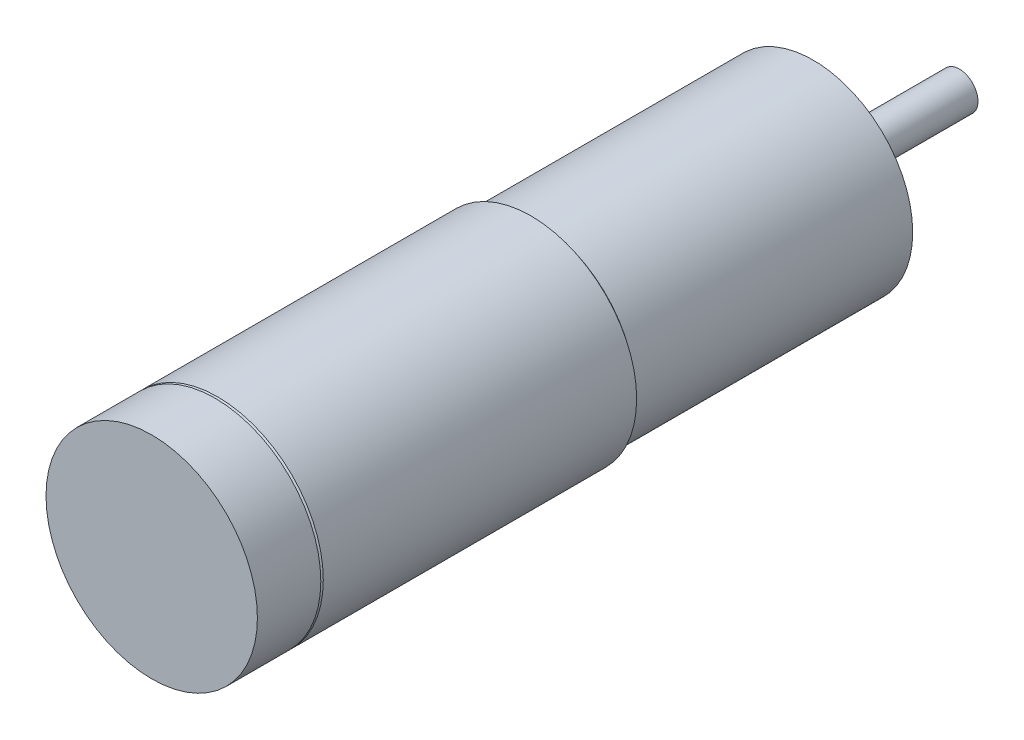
ISO-10303-21;
HEADER;
FILE_DESCRIPTION(('STEP AP214'),'2;1');
FILE_NAME('part.step','',(''),(''),'','','');
FILE_SCHEMA(('AUTOMOTIVE_DESIGN { 1 0 10303 214 1 1 1 1 }'));
ENDSEC;
DATA;
#1=APPLICATION_CONTEXT('core data for automotive mechanical design processes');
#2=APPLICATION_PROTOCOL_DEFINITION('international standard','automotive_design',2000,#1);
#3=PRODUCT_CONTEXT('',#1,'mechanical');
#4=PRODUCT('Part','Part','',(#3));
#5=PRODUCT_RELATED_PRODUCT_CATEGORY('part','',(#4));
#6=PRODUCT_DEFINITION_FORMATION('','',#4);
#7=PRODUCT_DEFINITION_CONTEXT('part definition',#1,'design');
#8=PRODUCT_DEFINITION('design','',#6,#7);
#9=PRODUCT_DEFINITION_SHAPE('','',#8);
#10=(LENGTH_UNIT() NAMED_UNIT(*) SI_UNIT(.MILLI.,.METRE.));
#11=(NAMED_UNIT(*) PLANE_ANGLE_UNIT() SI_UNIT($,.RADIAN.));
#12=(NAMED_UNIT(*) SI_UNIT($,.STERADIAN.) SOLID_ANGLE_UNIT());
#13=UNCERTAINTY_MEASURE_WITH_UNIT(LENGTH_MEASURE(1.E-05),#10,'distance_accuracy_value','');
#14=(GEOMETRIC_REPRESENTATION_CONTEXT(3) GLOBAL_UNCERTAINTY_ASSIGNED_CONTEXT((#13)) GLOBAL_UNIT_ASSIGNED_CONTEXT((#10,
#11,#12)) REPRESENTATION_CONTEXT('',''));
#15=CARTESIAN_POINT('',(0.,0.,0.));
#16=DIRECTION('',(0.,0.,1.));
#17=DIRECTION('',(1.,0.,0.));
#18=AXIS2_PLACEMENT_3D('',#15,#16,#17);
#19=CARTESIAN_POINT('',(0.,0.,-2.6));
#20=DIRECTION('',(0.,0.,-0.999999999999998));
#21=DIRECTION('',(-1.,0.,0.));
#22=AXIS2_PLACEMENT_3D('',#19,#20,#21);
#23=PLANE('',#22);
#24=CARTESIAN_POINT('',(0.,0.,-2.6));
#25=DIRECTION('',(0.,0.,-0.999999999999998));
#26=DIRECTION('',(-1.,0.,0.));
#27=AXIS2_PLACEMENT_3D('',#24,#25,#26);
#28=CIRCLE('',#27,3.);
#29=CARTESIAN_POINT('',(3.,0.,-2.6));
#30=VERTEX_POINT('',#29);
#31=EDGE_CURVE('E48',#30,#30,#28,.T.);
#32=ORIENTED_EDGE('',*,*,#31,.T.);
#33=EDGE_LOOP('',(#32));
#34=FACE_BOUND('',#33,.T.);
#35=CARTESIAN_POINT('',(0.,0.,-2.6));
#36=DIRECTION('',(0.,0.,-0.999999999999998));
#37=DIRECTION('',(-1.,0.,0.));
#38=AXIS2_PLACEMENT_3D('',#35,#36,#37);
#39=CIRCLE('',#38,1.5);
#40=CARTESIAN_POINT('',(1.5,0.,-2.6));
#41=VERTEX_POINT('',#40);
#42=EDGE_CURVE('E46',#41,#41,#39,.F.);
#43=ORIENTED_EDGE('',*,*,#42,.T.);
#44=EDGE_LOOP('',(#43));
#45=FACE_BOUND('',#44,.T.);
#46=ADVANCED_FACE('F28',(#34,#45),#23,.T.);
#47=CARTESIAN_POINT('',(0.,0.,0.));
#48=DIRECTION('',(0.,0.,0.999999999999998));
#49=DIRECTION('',(1.,0.,0.));
#50=AXIS2_PLACEMENT_3D('',#47,#48,#49);
#51=PLANE('',#50);
#52=CARTESIAN_POINT('',(0.,0.,0.));
#53=DIRECTION('',(0.,0.,0.999999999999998));
#54=DIRECTION('',(1.,0.,0.));
#55=AXIS2_PLACEMENT_3D('',#52,#53,#54);
#56=CIRCLE('',#55,8.);
#57=CARTESIAN_POINT('',(-8.,0.,0.));
#58=VERTEX_POINT('',#57);
#59=EDGE_CURVE('E56',#58,#58,#56,.T.);
#60=ORIENTED_EDGE('',*,*,#59,.F.);
#61=EDGE_LOOP('',(#60));
#62=FACE_BOUND('',#61,.T.);
#63=CARTESIAN_POINT('',(0.,0.,0.));
#64=DIRECTION('',(0.,0.,0.999999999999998));
#65=DIRECTION('',(1.,0.,0.));
#66=AXIS2_PLACEMENT_3D('',#63,#64,#65);
#67=CIRCLE('',#66,3.);
#68=CARTESIAN_POINT('',(3.,0.,0.));
#69=VERTEX_POINT('',#68);
#70=EDGE_CURVE('E39',#69,#69,#67,.F.);
#71=ORIENTED_EDGE('',*,*,#70,.F.);
#72=EDGE_LOOP('',(#71));
#73=FACE_BOUND('',#72,.T.);
#74=ADVANCED_FACE('F85',(#62,#73),#51,.F.);
#75=CARTESIAN_POINT('',(0.,0.,22.7));
#76=DIRECTION('',(0.,0.,-0.999999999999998));
#77=DIRECTION('',(-1.,0.,0.));
#78=AXIS2_PLACEMENT_3D('',#75,#76,#77);
#79=CYLINDRICAL_SURFACE('',#78,8.);
#80=CARTESIAN_POINT('',(0.,0.,22.319));
#81=DIRECTION('',(0.,0.,0.999999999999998));
#82=DIRECTION('',(1.,0.,0.));
#83=AXIS2_PLACEMENT_3D('',#80,#81,#82);
#84=CIRCLE('',#83,8.);
#85=CARTESIAN_POINT('',(-8.,0.,22.319));
#86=VERTEX_POINT('',#85);
#87=EDGE_CURVE('E43',#86,#86,#84,.F.);
#88=CARTESIAN_POINT('',(-8.,0.,22.319));
#89=CARTESIAN_POINT('',(-8.,0.,22.0865104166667));
#90=CARTESIAN_POINT('',(-8.,0.,21.8540208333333));
#91=CARTESIAN_POINT('',(-8.,0.,21.3890416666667));
#92=CARTESIAN_POINT('',(-8.,0.,21.1565520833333));
#93=CARTESIAN_POINT('',(-8.,0.,20.6915729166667));
#94=CARTESIAN_POINT('',(-8.,0.,20.4590833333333));
#95=CARTESIAN_POINT('',(-8.,0.,19.9941041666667));
#96=CARTESIAN_POINT('',(-8.,0.,19.7616145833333));
#97=CARTESIAN_POINT('',(-8.,0.,19.2966354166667));
#98=CARTESIAN_POINT('',(-8.,0.,19.0641458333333));
#99=CARTESIAN_POINT('',(-8.,0.,18.5991666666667));
#100=CARTESIAN_POINT('',(-8.,0.,18.3666770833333));
#101=CARTESIAN_POINT('',(-8.,0.,17.9016979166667));
#102=CARTESIAN_POINT('',(-8.,0.,17.6692083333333));
#103=CARTESIAN_POINT('',(-8.,0.,17.2042291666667));
#104=CARTESIAN_POINT('',(-8.,0.,16.9717395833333));
#105=CARTESIAN_POINT('',(-8.,0.,16.5067604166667));
#106=CARTESIAN_POINT('',(-8.,0.,16.2742708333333));
#107=CARTESIAN_POINT('',(-8.,0.,15.8092916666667));
#108=CARTESIAN_POINT('',(-8.,0.,15.5768020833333));
#109=CARTESIAN_POINT('',(-8.,0.,15.1118229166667));
#110=CARTESIAN_POINT('',(-8.,0.,14.8793333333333));
#111=CARTESIAN_POINT('',(-8.,0.,14.4143541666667));
#112=CARTESIAN_POINT('',(-8.,0.,14.1818645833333));
#113=CARTESIAN_POINT('',(-8.,0.,13.7168854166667));
#114=CARTESIAN_POINT('',(-8.,0.,13.4843958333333));
#115=CARTESIAN_POINT('',(-8.,0.,13.0194166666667));
#116=CARTESIAN_POINT('',(-8.,0.,12.7869270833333));
#117=CARTESIAN_POINT('',(-8.,0.,12.3219479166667));
#118=CARTESIAN_POINT('',(-8.,0.,12.0894583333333));
#119=CARTESIAN_POINT('',(-8.,0.,11.6244791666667));
#120=CARTESIAN_POINT('',(-8.,0.,11.3919895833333));
#121=CARTESIAN_POINT('',(-8.,0.,10.9270104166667));
#122=CARTESIAN_POINT('',(-8.,0.,10.6945208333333));
#123=CARTESIAN_POINT('',(-8.,0.,10.2295416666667));
#124=CARTESIAN_POINT('',(-8.,0.,9.99705208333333));
#125=CARTESIAN_POINT('',(-8.,0.,9.53207291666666));
#126=CARTESIAN_POINT('',(-8.,0.,9.29958333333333));
#127=CARTESIAN_POINT('',(-8.,0.,8.83460416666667));
#128=CARTESIAN_POINT('',(-8.,0.,8.60211458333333));
#129=CARTESIAN_POINT('',(-8.,0.,8.13713541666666));
#130=CARTESIAN_POINT('',(-8.,0.,7.90464583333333));
#131=CARTESIAN_POINT('',(-8.,0.,7.43966666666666));
#132=CARTESIAN_POINT('',(-8.,0.,7.20717708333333));
#133=CARTESIAN_POINT('',(-8.,0.,6.74219791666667));
#134=CARTESIAN_POINT('',(-8.,0.,6.50970833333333));
#135=CARTESIAN_POINT('',(-8.,0.,6.04472916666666));
#136=CARTESIAN_POINT('',(-8.,0.,5.81223958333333));
#137=CARTESIAN_POINT('',(-8.,0.,5.34726041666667));
#138=CARTESIAN_POINT('',(-8.,0.,5.11477083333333));
#139=CARTESIAN_POINT('',(-8.,0.,4.64979166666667));
#140=CARTESIAN_POINT('',(-8.,0.,4.41730208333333));
#141=CARTESIAN_POINT('',(-8.,0.,3.95232291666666));
#142=CARTESIAN_POINT('',(-8.,0.,3.71983333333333));
#143=CARTESIAN_POINT('',(-8.,0.,3.25485416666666));
#144=CARTESIAN_POINT('',(-8.,0.,3.02236458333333));
#145=CARTESIAN_POINT('',(-8.,0.,2.55738541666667));
#146=CARTESIAN_POINT('',(-8.,0.,2.32489583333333));
#147=CARTESIAN_POINT('',(-8.,0.,1.85991666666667));
#148=CARTESIAN_POINT('',(-8.,0.,1.62742708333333));
#149=CARTESIAN_POINT('',(-8.,0.,1.16244791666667));
#150=CARTESIAN_POINT('',(-8.,0.,0.929958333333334));
#151=CARTESIAN_POINT('',(-8.,0.,0.464979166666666));
#152=CARTESIAN_POINT('',(-8.,0.,0.232489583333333));
#153=CARTESIAN_POINT('',(-8.,0.,0.));
#154=B_SPLINE_CURVE_WITH_KNOTS('',3,(#88,#89,#90,#91,#92,#93,#94,#95,#96,#97,#98,#99,#100,#101,
#102,#103,#104,#105,#106,#107,#108,#109,#110,#111,#112,#113,#114,#115,#116,#117,#118,#119,#120,
#121,#122,#123,#124,#125,#126,#127,#128,#129,#130,#131,#132,#133,#134,#135,#136,#137,#138,#139,
#140,#141,#142,#143,#144,#145,#146,#147,#148,#149,#150,#151,#152,#153),.UNSPECIFIED.,.F.,.F.,(4,
2,2,2,2,2,2,2,2,2,2,2,2,2,2,2,2,2,2,2,2,2,2,2,2,2,2,2,2,2,2,2,4),(0.,0.697468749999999,
1.3949375,2.09240625,2.789875,3.48734375,4.1848125,4.88228124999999,5.57974999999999,6.27721875,
6.97468749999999,7.67215624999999,8.36962499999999,9.06709374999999,9.76456249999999,
10.46203125,11.1595,11.85696875,12.5544375,13.25190625,13.949375,14.64684375,15.3443125,
16.04178125,16.73925,17.43671875,18.1341875,18.83165625,19.529125,20.22659375,20.9240625,
21.62153125,22.319),.UNSPECIFIED.);
#155=EDGE_CURVE('BSEAM30',#86,#58,#154,.T.);
#156=ORIENTED_EDGE('',*,*,#87,.T.);
#157=ORIENTED_EDGE('',*,*,#59,.T.);
#158=ORIENTED_EDGE('',*,*,#155,.T.);
#159=ORIENTED_EDGE('',*,*,#155,.F.);
#160=EDGE_LOOP('',(#156,#158,#157,#159));
#161=FACE_BOUND('',#160,.T.);
#162=ADVANCED_FACE('F30',(#161),#79,.T.);
#163=CARTESIAN_POINT('',(0.,0.,22.7));
#164=DIRECTION('',(0.,0.,-0.999999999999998));
#165=DIRECTION('',(-1.,0.,0.));
#166=AXIS2_PLACEMENT_3D('',#163,#164,#165);
#167=CONICAL_SURFACE('',#166,7.619,0.785398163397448);
#168=CARTESIAN_POINT('',(0.,0.,22.7));
#169=DIRECTION('',(0.,0.,0.999999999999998));
#170=DIRECTION('',(1.,0.,0.));
#171=AXIS2_PLACEMENT_3D('',#168,#169,#170);
#172=CIRCLE('',#171,7.619);
#173=CARTESIAN_POINT('',(-7.619,0.,22.7));
#174=VERTEX_POINT('',#173);
#175=EDGE_CURVE('E53',#174,#174,#172,.T.);
#176=CARTESIAN_POINT('',(-8.00000000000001,0.,22.319));
#177=CARTESIAN_POINT('',(-7.99603125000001,0.,22.32296875));
#178=CARTESIAN_POINT('',(-7.99206250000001,0.,22.3269375));
#179=CARTESIAN_POINT('',(-7.98412500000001,0.,22.334875));
#180=CARTESIAN_POINT('',(-7.98015625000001,0.,22.33884375));
#181=CARTESIAN_POINT('',(-7.97221875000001,0.,22.34678125));
#182=CARTESIAN_POINT('',(-7.96825000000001,0.,22.35075));
#183=CARTESIAN_POINT('',(-7.96031250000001,0.,22.3586875));
#184=CARTESIAN_POINT('',(-7.95634375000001,0.,22.36265625));
#185=CARTESIAN_POINT('',(-7.94840625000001,0.,22.37059375));
#186=CARTESIAN_POINT('',(-7.94443750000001,0.,22.3745625));
#187=CARTESIAN_POINT('',(-7.93650000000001,0.,22.3825));
#188=CARTESIAN_POINT('',(-7.93253125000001,0.,22.38646875));
#189=CARTESIAN_POINT('',(-7.92459375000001,0.,22.39440625));
#190=CARTESIAN_POINT('',(-7.92062500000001,0.,22.398375));
#191=CARTESIAN_POINT('',(-7.91268750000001,0.,22.4063125));
#192=CARTESIAN_POINT('',(-7.90871875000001,0.,22.41028125));
#193=CARTESIAN_POINT('',(-7.90078125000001,0.,22.41821875));
#194=CARTESIAN_POINT('',(-7.89681250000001,0.,22.4221875));
#195=CARTESIAN_POINT('',(-7.88887500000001,0.,22.430125));
#196=CARTESIAN_POINT('',(-7.88490625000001,0.,22.43409375));
#197=CARTESIAN_POINT('',(-7.87696875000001,0.,22.44203125));
#198=CARTESIAN_POINT('',(-7.87300000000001,0.,22.446));
#199=CARTESIAN_POINT('',(-7.86506250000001,0.,22.4539375));
#200=CARTESIAN_POINT('',(-7.86109375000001,0.,22.45790625));
#201=CARTESIAN_POINT('',(-7.85315625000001,0.,22.46584375));
#202=CARTESIAN_POINT('',(-7.84918750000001,0.,22.4698125));
#203=CARTESIAN_POINT('',(-7.84125000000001,0.,22.47775));
#204=CARTESIAN_POINT('',(-7.83728125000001,0.,22.48171875));
#205=CARTESIAN_POINT('',(-7.82934375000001,0.,22.48965625));
#206=CARTESIAN_POINT('',(-7.82537500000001,0.,22.493625));
#207=CARTESIAN_POINT('',(-7.81743750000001,0.,22.5015625));
#208=CARTESIAN_POINT('',(-7.81346875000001,0.,22.50553125));
#209=CARTESIAN_POINT('',(-7.80553125,0.,22.51346875));
#210=CARTESIAN_POINT('',(-7.80156250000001,0.,22.5174375));
#211=CARTESIAN_POINT('',(-7.79362500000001,0.,22.525375));
#212=CARTESIAN_POINT('',(-7.78965625,0.,22.52934375));
#213=CARTESIAN_POINT('',(-7.78171875,0.,22.53728125));
#214=CARTESIAN_POINT('',(-7.77775000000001,0.,22.54125));
#215=CARTESIAN_POINT('',(-7.76981250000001,0.,22.5491875));
#216=CARTESIAN_POINT('',(-7.76584375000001,0.,22.55315625));
#217=CARTESIAN_POINT('',(-7.75790625,0.,22.56109375));
#218=CARTESIAN_POINT('',(-7.7539375,0.,22.5650625));
#219=CARTESIAN_POINT('',(-7.746,0.,22.573));
#220=CARTESIAN_POINT('',(-7.74203125,0.,22.57696875));
#221=CARTESIAN_POINT('',(-7.73409375,0.,22.58490625));
#222=CARTESIAN_POINT('',(-7.73012500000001,0.,22.588875));
#223=CARTESIAN_POINT('',(-7.7221875,0.,22.5968125));
#224=CARTESIAN_POINT('',(-7.71821875,0.,22.60078125));
#225=CARTESIAN_POINT('',(-7.71028125,0.,22.60871875));
#226=CARTESIAN_POINT('',(-7.7063125,0.,22.6126875));
#227=CARTESIAN_POINT('',(-7.698375,0.,22.620625));
#228=CARTESIAN_POINT('',(-7.69440625,0.,22.62459375));
#229=CARTESIAN_POINT('',(-7.68646875,0.,22.63253125));
#230=CARTESIAN_POINT('',(-7.6825,0.,22.6365));
#231=CARTESIAN_POINT('',(-7.6745625,0.,22.6444375));
#232=CARTESIAN_POINT('',(-7.67059375,0.,22.64840625));
#233=CARTESIAN_POINT('',(-7.66265625,0.,22.65634375));
#234=CARTESIAN_POINT('',(-7.6586875,0.,22.6603125));
#235=CARTESIAN_POINT('',(-7.65075,0.,22.66825));
#236=CARTESIAN_POINT('',(-7.64678125,0.,22.67221875));
#237=CARTESIAN_POINT('',(-7.63884375,0.,22.68015625));
#238=CARTESIAN_POINT('',(-7.634875,0.,22.684125));
#239=CARTESIAN_POINT('',(-7.6269375,0.,22.6920625));
#240=CARTESIAN_POINT('',(-7.62296875,0.,22.69603125));
#241=CARTESIAN_POINT('',(-7.619,0.,22.7));
#242=B_SPLINE_CURVE_WITH_KNOTS('',3,(#176,#177,#178,#179,#180,#181,#182,#183,#184,#185,#186,
#187,#188,#189,#190,#191,#192,#193,#194,#195,#196,#197,#198,#199,#200,#201,#202,#203,#204,#205,
#206,#207,#208,#209,#210,#211,#212,#213,#214,#215,#216,#217,#218,#219,#220,#221,#222,#223,#224,
#225,#226,#227,#228,#229,#230,#231,#232,#233,#234,#235,#236,#237,#238,#239,#240,#241),
.UNSPECIFIED.,.F.,.F.,(4,2,2,2,2,2,2,2,2,2,2,2,2,2,2,2,2,2,2,2,2,2,2,2,2,2,2,2,2,2,2,2,4),(0.,
0.0168379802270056,0.0336759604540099,0.0505139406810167,0.067351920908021,0.0841899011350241,
0.101027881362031,0.117865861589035,0.13470384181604,0.151541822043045,0.168379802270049,
0.185217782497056,0.202055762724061,0.218893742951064,0.23573172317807,0.252569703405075,
0.269407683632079,0.286245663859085,0.30308364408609,0.319921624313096,0.3367596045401,
0.353597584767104,0.370435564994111,0.387273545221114,0.404111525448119,0.420949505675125,
0.437787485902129,0.454625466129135,0.47146344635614,0.488301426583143,0.50513940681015,
0.521977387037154,0.538815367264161),.UNSPECIFIED.);
#243=EDGE_CURVE('BSEAM108',#86,#174,#242,.T.);
#244=ORIENTED_EDGE('',*,*,#87,.F.);
#245=ORIENTED_EDGE('',*,*,#175,.F.);
#246=ORIENTED_EDGE('',*,*,#243,.T.);
#247=ORIENTED_EDGE('',*,*,#243,.F.);
#248=EDGE_LOOP('',(#244,#246,#245,#247));
#249=FACE_BOUND('',#248,.T.);
#250=ADVANCED_FACE('F108',(#249),#167,.T.);
#251=CARTESIAN_POINT('',(0.,0.,48.0999999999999));
#252=DIRECTION('',(0.,0.,-0.999999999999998));
#253=DIRECTION('',(-1.,0.,0.));
#254=AXIS2_PLACEMENT_3D('',#251,#252,#253);
#255=CYLINDRICAL_SURFACE('',#254,8.5);
#256=CARTESIAN_POINT('',(0.,0.,47.8999999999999));
#257=DIRECTION('',(0.,0.,0.999999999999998));
#258=DIRECTION('',(1.,0.,0.));
#259=AXIS2_PLACEMENT_3D('',#256,#257,#258);
#260=CIRCLE('',#259,8.5);
#261=CARTESIAN_POINT('',(-8.5,0.,47.8999999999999));
#262=VERTEX_POINT('',#261);
#263=EDGE_CURVE('E10',#262,#262,#260,.F.);
#264=CARTESIAN_POINT('',(0.,0.,22.7));
#265=DIRECTION('',(0.,0.,0.999999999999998));
#266=DIRECTION('',(1.,0.,0.));
#267=AXIS2_PLACEMENT_3D('',#264,#265,#266);
#268=CIRCLE('',#267,8.5);
#269=CARTESIAN_POINT('',(-8.5,0.,22.7));
#270=VERTEX_POINT('',#269);
#271=EDGE_CURVE('E59',#270,#270,#268,.T.);
#272=CARTESIAN_POINT('',(-8.5,0.,47.8999999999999));
#273=CARTESIAN_POINT('',(-8.5,0.,47.6374999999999));
#274=CARTESIAN_POINT('',(-8.5,0.,47.3749999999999));
#275=CARTESIAN_POINT('',(-8.5,0.,46.8499999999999));
#276=CARTESIAN_POINT('',(-8.5,0.,46.5874999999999));
#277=CARTESIAN_POINT('',(-8.5,0.,46.0624999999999));
#278=CARTESIAN_POINT('',(-8.5,0.,45.7999999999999));
#279=CARTESIAN_POINT('',(-8.5,0.,45.2749999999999));
#280=CARTESIAN_POINT('',(-8.5,0.,45.0124999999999));
#281=CARTESIAN_POINT('',(-8.5,0.,44.4874999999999));
#282=CARTESIAN_POINT('',(-8.5,0.,44.2249999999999));
#283=CARTESIAN_POINT('',(-8.5,0.,43.6999999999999));
#284=CARTESIAN_POINT('',(-8.5,0.,43.4374999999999));
#285=CARTESIAN_POINT('',(-8.5,0.,42.9124999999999));
#286=CARTESIAN_POINT('',(-8.5,0.,42.6499999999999));
#287=CARTESIAN_POINT('',(-8.5,0.,42.1249999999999));
#288=CARTESIAN_POINT('',(-8.5,0.,41.8624999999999));
#289=CARTESIAN_POINT('',(-8.5,0.,41.3374999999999));
#290=CARTESIAN_POINT('',(-8.5,0.,41.0749999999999));
#291=CARTESIAN_POINT('',(-8.5,0.,40.5499999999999));
#292=CARTESIAN_POINT('',(-8.5,0.,40.2874999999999));
#293=CARTESIAN_POINT('',(-8.5,0.,39.7624999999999));
#294=CARTESIAN_POINT('',(-8.5,0.,39.4999999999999));
#295=CARTESIAN_POINT('',(-8.5,0.,38.9749999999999));
#296=CARTESIAN_POINT('',(-8.5,0.,38.7124999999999));
#297=CARTESIAN_POINT('',(-8.5,0.,38.1874999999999));
#298=CARTESIAN_POINT('',(-8.5,0.,37.9249999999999));
#299=CARTESIAN_POINT('',(-8.5,0.,37.3999999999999));
#300=CARTESIAN_POINT('',(-8.5,0.,37.1374999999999));
#301=CARTESIAN_POINT('',(-8.5,0.,36.6124999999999));
#302=CARTESIAN_POINT('',(-8.5,0.,36.3499999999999));
#303=CARTESIAN_POINT('',(-8.5,0.,35.8249999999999));
#304=CARTESIAN_POINT('',(-8.5,0.,35.5624999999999));
#305=CARTESIAN_POINT('',(-8.5,0.,35.0374999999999));
#306=CARTESIAN_POINT('',(-8.5,0.,34.7749999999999));
#307=CARTESIAN_POINT('',(-8.5,0.,34.2499999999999));
#308=CARTESIAN_POINT('',(-8.5,0.,33.9874999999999));
#309=CARTESIAN_POINT('',(-8.5,0.,33.4624999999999));
#310=CARTESIAN_POINT('',(-8.5,0.,33.1999999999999));
#311=CARTESIAN_POINT('',(-8.5,0.,32.6749999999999));
#312=CARTESIAN_POINT('',(-8.5,0.,32.4125));
#313=CARTESIAN_POINT('',(-8.5,0.,31.8875));
#314=CARTESIAN_POINT('',(-8.5,0.,31.625));
#315=CARTESIAN_POINT('',(-8.5,0.,31.1));
#316=CARTESIAN_POINT('',(-8.5,0.,30.8375));
#317=CARTESIAN_POINT('',(-8.5,0.,30.3125));
#318=CARTESIAN_POINT('',(-8.5,0.,30.05));
#319=CARTESIAN_POINT('',(-8.5,0.,29.525));
#320=CARTESIAN_POINT('',(-8.5,0.,29.2625));
#321=CARTESIAN_POINT('',(-8.5,0.,28.7375));
#322=CARTESIAN_POINT('',(-8.5,0.,28.475));
#323=CARTESIAN_POINT('',(-8.5,0.,27.95));
#324=CARTESIAN_POINT('',(-8.5,0.,27.6875));
#325=CARTESIAN_POINT('',(-8.5,0.,27.1625));
#326=CARTESIAN_POINT('',(-8.5,0.,26.9));
#327=CARTESIAN_POINT('',(-8.5,0.,26.375));
#328=CARTESIAN_POINT('',(-8.5,0.,26.1125));
#329=CARTESIAN_POINT('',(-8.5,0.,25.5875));
#330=CARTESIAN_POINT('',(-8.5,0.,25.325));
#331=CARTESIAN_POINT('',(-8.5,0.,24.8));
#332=CARTESIAN_POINT('',(-8.5,0.,24.5375));
#333=CARTESIAN_POINT('',(-8.5,0.,24.0125));
#334=CARTESIAN_POINT('',(-8.5,0.,23.75));
#335=CARTESIAN_POINT('',(-8.5,0.,23.225));
#336=CARTESIAN_POINT('',(-8.5,0.,22.9625));
#337=CARTESIAN_POINT('',(-8.5,0.,22.7));
#338=B_SPLINE_CURVE_WITH_KNOTS('',3,(#272,#273,#274,#275,#276,#277,#278,#279,#280,#281,#282,
#283,#284,#285,#286,#287,#288,#289,#290,#291,#292,#293,#294,#295,#296,#297,#298,#299,#300,#301,
#302,#303,#304,#305,#306,#307,#308,#309,#310,#311,#312,#313,#314,#315,#316,#317,#318,#319,#320,
#321,#322,#323,#324,#325,#326,#327,#328,#329,#330,#331,#332,#333,#334,#335,#336,#337),
.UNSPECIFIED.,.F.,.F.,(4,2,2,2,2,2,2,2,2,2,2,2,2,2,2,2,2,2,2,2,2,2,2,2,2,2,2,2,2,2,2,2,4),(0.,
0.78749999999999,1.57499999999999,2.36249999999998,3.14999999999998,3.93749999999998,
4.72499999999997,5.51249999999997,6.29999999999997,7.08749999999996,7.87499999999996,
8.66249999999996,9.44999999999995,10.2374999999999,11.0249999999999,11.8124999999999,
12.5999999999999,13.3874999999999,14.1749999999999,14.9624999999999,15.7499999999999,
16.5374999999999,17.3249999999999,18.1124999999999,18.8999999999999,19.6874999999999,
20.4749999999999,21.2624999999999,22.0499999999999,22.8374999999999,23.6249999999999,
24.4124999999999,25.1999999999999),.UNSPECIFIED.);
#339=EDGE_CURVE('BSEAM104',#262,#270,#338,.T.);
#340=ORIENTED_EDGE('',*,*,#263,.T.);
#341=ORIENTED_EDGE('',*,*,#271,.T.);
#342=ORIENTED_EDGE('',*,*,#339,.T.);
#343=ORIENTED_EDGE('',*,*,#339,.F.);
#344=EDGE_LOOP('',(#340,#342,#341,#343));
#345=FACE_BOUND('',#344,.T.);
#346=ADVANCED_FACE('F104',(#345),#255,.T.);
#347=CARTESIAN_POINT('',(0.,0.,22.7));
#348=DIRECTION('',(0.,0.,0.999999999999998));
#349=DIRECTION('',(1.,0.,0.));
#350=AXIS2_PLACEMENT_3D('',#347,#348,#349);
#351=PLANE('',#350);
#352=ORIENTED_EDGE('',*,*,#175,.T.);
#353=EDGE_LOOP('',(#352));
#354=FACE_BOUND('',#353,.T.);
#355=ORIENTED_EDGE('',*,*,#271,.F.);
#356=EDGE_LOOP('',(#355));
#357=FACE_BOUND('',#356,.T.);
#358=ADVANCED_FACE('F100',(#354,#357),#351,.F.);
#359=CARTESIAN_POINT('',(0.,0.,-2.6));
#360=DIRECTION('',(0.,0.,0.999999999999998));
#361=DIRECTION('',(1.,0.,0.));
#362=AXIS2_PLACEMENT_3D('',#359,#360,#361);
#363=CYLINDRICAL_SURFACE('',#362,3.);
#364=CARTESIAN_POINT('',(3.,0.,-2.6));
#365=CARTESIAN_POINT('',(3.,0.,-2.57291666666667));
#366=CARTESIAN_POINT('',(3.,0.,-2.54583333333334));
#367=CARTESIAN_POINT('',(3.,0.,-2.49166666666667));
#368=CARTESIAN_POINT('',(3.,0.,-2.46458333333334));
#369=CARTESIAN_POINT('',(3.,0.,-2.41041666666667));
#370=CARTESIAN_POINT('',(3.,0.,-2.38333333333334));
#371=CARTESIAN_POINT('',(3.,0.,-2.32916666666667));
#372=CARTESIAN_POINT('',(3.,0.,-2.30208333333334));
#373=CARTESIAN_POINT('',(3.,0.,-2.24791666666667));
#374=CARTESIAN_POINT('',(3.,0.,-2.22083333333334));
#375=CARTESIAN_POINT('',(3.,0.,-2.16666666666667));
#376=CARTESIAN_POINT('',(3.,0.,-2.13958333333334));
#377=CARTESIAN_POINT('',(3.,0.,-2.08541666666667));
#378=CARTESIAN_POINT('',(3.,0.,-2.05833333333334));
#379=CARTESIAN_POINT('',(3.,0.,-2.00416666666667));
#380=CARTESIAN_POINT('',(3.,0.,-1.97708333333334));
#381=CARTESIAN_POINT('',(3.,0.,-1.92291666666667));
#382=CARTESIAN_POINT('',(3.,0.,-1.89583333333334));
#383=CARTESIAN_POINT('',(3.,0.,-1.84166666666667));
#384=CARTESIAN_POINT('',(3.,0.,-1.81458333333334));
#385=CARTESIAN_POINT('',(3.,0.,-1.76041666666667));
#386=CARTESIAN_POINT('',(3.,0.,-1.73333333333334));
#387=CARTESIAN_POINT('',(3.,0.,-1.67916666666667));
#388=CARTESIAN_POINT('',(3.,0.,-1.65208333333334));
#389=CARTESIAN_POINT('',(3.,0.,-1.59791666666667));
#390=CARTESIAN_POINT('',(3.,0.,-1.57083333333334));
#391=CARTESIAN_POINT('',(3.,0.,-1.51666666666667));
#392=CARTESIAN_POINT('',(3.,0.,-1.48958333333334));
#393=CARTESIAN_POINT('',(3.,0.,-1.43541666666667));
#394=CARTESIAN_POINT('',(3.,0.,-1.40833333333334));
#395=CARTESIAN_POINT('',(3.,0.,-1.35416666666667));
#396=CARTESIAN_POINT('',(3.,0.,-1.32708333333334));
#397=CARTESIAN_POINT('',(3.,0.,-1.27291666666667));
#398=CARTESIAN_POINT('',(3.,0.,-1.24583333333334));
#399=CARTESIAN_POINT('',(3.,0.,-1.19166666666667));
#400=CARTESIAN_POINT('',(3.,0.,-1.16458333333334));
#401=CARTESIAN_POINT('',(3.,0.,-1.11041666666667));
#402=CARTESIAN_POINT('',(3.,0.,-1.08333333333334));
#403=CARTESIAN_POINT('',(3.,0.,-1.02916666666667));
#404=CARTESIAN_POINT('',(3.,0.,-1.00208333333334));
#405=CARTESIAN_POINT('',(3.,0.,-0.947916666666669));
#406=CARTESIAN_POINT('',(3.,0.,-0.920833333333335));
#407=CARTESIAN_POINT('',(3.,0.,-0.866666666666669));
#408=CARTESIAN_POINT('',(3.,0.,-0.839583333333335));
#409=CARTESIAN_POINT('',(3.,0.,-0.785416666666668));
#410=CARTESIAN_POINT('',(3.,0.,-0.758333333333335));
#411=CARTESIAN_POINT('',(3.,0.,-0.704166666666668));
#412=CARTESIAN_POINT('',(3.,0.,-0.677083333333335));
#413=CARTESIAN_POINT('',(3.,0.,-0.622916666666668));
#414=CARTESIAN_POINT('',(3.,0.,-0.595833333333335));
#415=CARTESIAN_POINT('',(3.,0.,-0.541666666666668));
#416=CARTESIAN_POINT('',(3.,0.,-0.514583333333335));
#417=CARTESIAN_POINT('',(3.,0.,-0.460416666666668));
#418=CARTESIAN_POINT('',(3.,0.,-0.433333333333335));
#419=CARTESIAN_POINT('',(3.,0.,-0.379166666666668));
#420=CARTESIAN_POINT('',(3.,0.,-0.352083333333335));
#421=CARTESIAN_POINT('',(3.,0.,-0.297916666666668));
#422=CARTESIAN_POINT('',(3.,0.,-0.270833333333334));
#423=CARTESIAN_POINT('',(3.,0.,-0.216666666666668));
#424=CARTESIAN_POINT('',(3.,0.,-0.189583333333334));
#425=CARTESIAN_POINT('',(3.,0.,-0.135416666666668));
#426=CARTESIAN_POINT('',(3.,0.,-0.108333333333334));
#427=CARTESIAN_POINT('',(3.,0.,-0.0541666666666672));
#428=CARTESIAN_POINT('',(3.,0.,-0.0270833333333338));
#429=CARTESIAN_POINT('',(3.,0.,0.));
#430=B_SPLINE_CURVE_WITH_KNOTS('',3,(#364,#365,#366,#367,#368,#369,#370,#371,#372,#373,#374,
#375,#376,#377,#378,#379,#380,#381,#382,#383,#384,#385,#386,#387,#388,#389,#390,#391,#392,#393,
#394,#395,#396,#397,#398,#399,#400,#401,#402,#403,#404,#405,#406,#407,#408,#409,#410,#411,#412,
#413,#414,#415,#416,#417,#418,#419,#420,#421,#422,#423,#424,#425,#426,#427,#428,#429),
.UNSPECIFIED.,.F.,.F.,(4,2,2,2,2,2,2,2,2,2,2,2,2,2,2,2,2,2,2,2,2,2,2,2,2,2,2,2,2,2,2,2,4),(0.,
0.0812500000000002,0.1625,0.24375,0.325000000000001,0.406250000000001,0.487500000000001,
0.568750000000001,0.650000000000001,0.731250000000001,0.812500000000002,0.893750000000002,
0.975000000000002,1.05625,1.1375,1.21875,1.3,1.38125,1.4625,1.54375,1.625,1.70625,1.7875,
1.86875,1.95,2.03125,2.1125,2.19375,2.275,2.35625,2.4375,2.51875,2.6),.UNSPECIFIED.);
#431=EDGE_CURVE('BSEAM97',#30,#69,#430,.T.);
#432=ORIENTED_EDGE('',*,*,#31,.F.);
#433=ORIENTED_EDGE('',*,*,#70,.T.);
#434=ORIENTED_EDGE('',*,*,#431,.T.);
#435=ORIENTED_EDGE('',*,*,#431,.F.);
#436=EDGE_LOOP('',(#432,#434,#433,#435));
#437=FACE_BOUND('',#436,.T.);
#438=ADVANCED_FACE('F97',(#437),#363,.T.);
#439=CARTESIAN_POINT('',(0.,0.,-11.75));
#440=DIRECTION('',(0.,0.,0.999999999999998));
#441=DIRECTION('',(1.,0.,0.));
#442=AXIS2_PLACEMENT_3D('',#439,#440,#441);
#443=CYLINDRICAL_SURFACE('',#442,1.5);
#444=CARTESIAN_POINT('',(0.,0.,-11.75));
#445=DIRECTION('',(0.,0.,-0.999999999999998));
#446=DIRECTION('',(-1.,0.,0.));
#447=AXIS2_PLACEMENT_3D('',#444,#445,#446);
#448=CIRCLE('',#447,1.5);
#449=CARTESIAN_POINT('',(1.5,0.,-11.75));
#450=VERTEX_POINT('',#449);
#451=EDGE_CURVE('E49',#450,#450,#448,.T.);
#452=CARTESIAN_POINT('',(1.5,0.,-2.6));
#453=CARTESIAN_POINT('',(1.5,0.,-2.6953125));
#454=CARTESIAN_POINT('',(1.5,0.,-2.790625));
#455=CARTESIAN_POINT('',(1.5,0.,-2.98125));
#456=CARTESIAN_POINT('',(1.5,0.,-3.0765625));
#457=CARTESIAN_POINT('',(1.5,0.,-3.2671875));
#458=CARTESIAN_POINT('',(1.5,0.,-3.3625));
#459=CARTESIAN_POINT('',(1.5,0.,-3.553125));
#460=CARTESIAN_POINT('',(1.5,0.,-3.6484375));
#461=CARTESIAN_POINT('',(1.5,0.,-3.8390625));
#462=CARTESIAN_POINT('',(1.5,0.,-3.934375));
#463=CARTESIAN_POINT('',(1.5,0.,-4.125));
#464=CARTESIAN_POINT('',(1.5,0.,-4.2203125));
#465=CARTESIAN_POINT('',(1.5,0.,-4.4109375));
#466=CARTESIAN_POINT('',(1.5,0.,-4.50625));
#467=CARTESIAN_POINT('',(1.5,0.,-4.696875));
#468=CARTESIAN_POINT('',(1.5,0.,-4.7921875));
#469=CARTESIAN_POINT('',(1.5,0.,-4.9828125));
#470=CARTESIAN_POINT('',(1.5,0.,-5.078125));
#471=CARTESIAN_POINT('',(1.5,0.,-5.26875));
#472=CARTESIAN_POINT('',(1.5,0.,-5.3640625));
#473=CARTESIAN_POINT('',(1.5,0.,-5.5546875));
#474=CARTESIAN_POINT('',(1.5,0.,-5.65));
#475=CARTESIAN_POINT('',(1.5,0.,-5.840625));
#476=CARTESIAN_POINT('',(1.5,0.,-5.9359375));
#477=CARTESIAN_POINT('',(1.5,0.,-6.1265625));
#478=CARTESIAN_POINT('',(1.5,0.,-6.221875));
#479=CARTESIAN_POINT('',(1.5,0.,-6.4125));
#480=CARTESIAN_POINT('',(1.5,0.,-6.5078125));
#481=CARTESIAN_POINT('',(1.5,0.,-6.6984375));
#482=CARTESIAN_POINT('',(1.5,0.,-6.79375));
#483=CARTESIAN_POINT('',(1.5,0.,-6.984375));
#484=CARTESIAN_POINT('',(1.5,0.,-7.0796875));
#485=CARTESIAN_POINT('',(1.5,0.,-7.2703125));
#486=CARTESIAN_POINT('',(1.5,0.,-7.365625));
#487=CARTESIAN_POINT('',(1.5,0.,-7.55625));
#488=CARTESIAN_POINT('',(1.5,0.,-7.6515625));
#489=CARTESIAN_POINT('',(1.5,0.,-7.8421875));
#490=CARTESIAN_POINT('',(1.5,0.,-7.9375));
#491=CARTESIAN_POINT('',(1.5,0.,-8.128125));
#492=CARTESIAN_POINT('',(1.5,0.,-8.2234375));
#493=CARTESIAN_POINT('',(1.5,0.,-8.4140625));
#494=CARTESIAN_POINT('',(1.5,0.,-8.509375));
#495=CARTESIAN_POINT('',(1.5,0.,-8.7));
#496=CARTESIAN_POINT('',(1.5,0.,-8.7953125));
#497=CARTESIAN_POINT('',(1.5,0.,-8.9859375));
#498=CARTESIAN_POINT('',(1.5,0.,-9.08125));
#499=CARTESIAN_POINT('',(1.5,0.,-9.271875));
#500=CARTESIAN_POINT('',(1.5,0.,-9.3671875));
#501=CARTESIAN_POINT('',(1.5,0.,-9.5578125));
#502=CARTESIAN_POINT('',(1.5,0.,-9.653125));
#503=CARTESIAN_POINT('',(1.5,0.,-9.84375));
#504=CARTESIAN_POINT('',(1.5,0.,-9.9390625));
#505=CARTESIAN_POINT('',(1.5,0.,-10.1296875));
#506=CARTESIAN_POINT('',(1.5,0.,-10.225));
#507=CARTESIAN_POINT('',(1.5,0.,-10.415625));
#508=CARTESIAN_POINT('',(1.5,0.,-10.5109375));
#509=CARTESIAN_POINT('',(1.5,0.,-10.7015625));
#510=CARTESIAN_POINT('',(1.5,0.,-10.796875));
#511=CARTESIAN_POINT('',(1.5,0.,-10.9875));
#512=CARTESIAN_POINT('',(1.5,0.,-11.0828125));
#513=CARTESIAN_POINT('',(1.5,0.,-11.2734375));
#514=CARTESIAN_POINT('',(1.5,0.,-11.36875));
#515=CARTESIAN_POINT('',(1.5,0.,-11.559375));
#516=CARTESIAN_POINT('',(1.5,0.,-11.6546875));
#517=CARTESIAN_POINT('',(1.5,0.,-11.75));
#518=B_SPLINE_CURVE_WITH_KNOTS('',3,(#452,#453,#454,#455,#456,#457,#458,#459,#460,#461,#462,
#463,#464,#465,#466,#467,#468,#469,#470,#471,#472,#473,#474,#475,#476,#477,#478,#479,#480,#481,
#482,#483,#484,#485,#486,#487,#488,#489,#490,#491,#492,#493,#494,#495,#496,#497,#498,#499,#500,
#501,#502,#503,#504,#505,#506,#507,#508,#509,#510,#511,#512,#513,#514,#515,#516,#517),
.UNSPECIFIED.,.F.,.F.,(4,2,2,2,2,2,2,2,2,2,2,2,2,2,2,2,2,2,2,2,2,2,2,2,2,2,2,2,2,2,2,2,4),(0.,
0.2859375,0.571874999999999,0.857812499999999,1.14375,1.4296875,1.715625,2.0015625,2.2875,
2.5734375,2.859375,3.1453125,3.43125,3.7171875,4.003125,4.2890625,4.575,4.8609375,5.146875,
5.4328125,5.71874999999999,6.00468749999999,6.29062499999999,6.57656249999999,6.86249999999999,
7.14843749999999,7.43437499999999,7.72031249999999,8.00624999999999,8.29218749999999,
8.57812499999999,8.86406249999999,9.14999999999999),.UNSPECIFIED.);
#519=EDGE_CURVE('BSEAM95',#41,#450,#518,.T.);
#520=ORIENTED_EDGE('',*,*,#42,.F.);
#521=ORIENTED_EDGE('',*,*,#451,.F.);
#522=ORIENTED_EDGE('',*,*,#519,.T.);
#523=ORIENTED_EDGE('',*,*,#519,.F.);
#524=EDGE_LOOP('',(#520,#522,#521,#523));
#525=FACE_BOUND('',#524,.T.);
#526=ADVANCED_FACE('F95',(#525),#443,.T.);
#527=CARTESIAN_POINT('',(0.,0.,-11.75));
#528=DIRECTION('',(0.,0.,-0.999999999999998));
#529=DIRECTION('',(-1.,0.,0.));
#530=AXIS2_PLACEMENT_3D('',#527,#528,#529);
#531=PLANE('',#530);
#532=ORIENTED_EDGE('',*,*,#451,.T.);
#533=EDGE_LOOP('',(#532));
#534=FACE_BOUND('',#533,.T.);
#535=ADVANCED_FACE('F166',(#534),#531,.T.);
#536=CARTESIAN_POINT('',(0.,0.,48.0999999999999));
#537=DIRECTION('',(0.,0.,-0.999999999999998));
#538=DIRECTION('',(-1.,0.,0.));
#539=AXIS2_PLACEMENT_3D('',#536,#537,#538);
#540=CONICAL_SURFACE('',#539,8.3,0.785398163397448);
#541=CARTESIAN_POINT('',(0.,0.,48.0999999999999));
#542=DIRECTION('',(0.,0.,0.999999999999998));
#543=DIRECTION('',(1.,0.,0.));
#544=AXIS2_PLACEMENT_3D('',#541,#542,#543);
#545=CIRCLE('',#544,8.3);
#546=CARTESIAN_POINT('',(-8.30000000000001,0.,48.0999999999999));
#547=VERTEX_POINT('',#546);
#548=EDGE_CURVE('E35',#547,#547,#545,.T.);
#549=CARTESIAN_POINT('',(-8.5,0.,47.8999999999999));
#550=CARTESIAN_POINT('',(-8.49791666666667,0.,47.9020833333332));
#551=CARTESIAN_POINT('',(-8.49583333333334,0.,47.9041666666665));
#552=CARTESIAN_POINT('',(-8.49166666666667,0.,47.9083333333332));
#553=CARTESIAN_POINT('',(-8.48958333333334,0.,47.9104166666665));
#554=CARTESIAN_POINT('',(-8.48541666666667,0.,47.9145833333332));
#555=CARTESIAN_POINT('',(-8.48333333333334,0.,47.9166666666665));
#556=CARTESIAN_POINT('',(-8.47916666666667,0.,47.9208333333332));
#557=CARTESIAN_POINT('',(-8.47708333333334,0.,47.9229166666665));
#558=CARTESIAN_POINT('',(-8.47291666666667,0.,47.9270833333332));
#559=CARTESIAN_POINT('',(-8.47083333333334,0.,47.9291666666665));
#560=CARTESIAN_POINT('',(-8.46666666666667,0.,47.9333333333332));
#561=CARTESIAN_POINT('',(-8.46458333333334,0.,47.9354166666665));
#562=CARTESIAN_POINT('',(-8.46041666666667,0.,47.9395833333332));
#563=CARTESIAN_POINT('',(-8.45833333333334,0.,47.9416666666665));
#564=CARTESIAN_POINT('',(-8.45416666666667,0.,47.9458333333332));
#565=CARTESIAN_POINT('',(-8.45208333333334,0.,47.9479166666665));
#566=CARTESIAN_POINT('',(-8.44791666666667,0.,47.9520833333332));
#567=CARTESIAN_POINT('',(-8.44583333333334,0.,47.9541666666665));
#568=CARTESIAN_POINT('',(-8.44166666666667,0.,47.9583333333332));
#569=CARTESIAN_POINT('',(-8.43958333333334,0.,47.9604166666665));
#570=CARTESIAN_POINT('',(-8.43541666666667,0.,47.9645833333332));
#571=CARTESIAN_POINT('',(-8.43333333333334,0.,47.9666666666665));
#572=CARTESIAN_POINT('',(-8.42916666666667,0.,47.9708333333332));
#573=CARTESIAN_POINT('',(-8.42708333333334,0.,47.9729166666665));
#574=CARTESIAN_POINT('',(-8.42291666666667,0.,47.9770833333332));
#575=CARTESIAN_POINT('',(-8.42083333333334,0.,47.9791666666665));
#576=CARTESIAN_POINT('',(-8.41666666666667,0.,47.9833333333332));
#577=CARTESIAN_POINT('',(-8.41458333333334,0.,47.9854166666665));
#578=CARTESIAN_POINT('',(-8.41041666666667,0.,47.9895833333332));
#579=CARTESIAN_POINT('',(-8.40833333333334,0.,47.9916666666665));
#580=CARTESIAN_POINT('',(-8.40416666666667,0.,47.9958333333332));
#581=CARTESIAN_POINT('',(-8.40208333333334,0.,47.9979166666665));
#582=CARTESIAN_POINT('',(-8.39791666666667,0.,48.0020833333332));
#583=CARTESIAN_POINT('',(-8.39583333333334,0.,48.0041666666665));
#584=CARTESIAN_POINT('',(-8.39166666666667,0.,48.0083333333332));
#585=CARTESIAN_POINT('',(-8.38958333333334,0.,48.0104166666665));
#586=CARTESIAN_POINT('',(-8.38541666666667,0.,48.0145833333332));
#587=CARTESIAN_POINT('',(-8.38333333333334,0.,48.0166666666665));
#588=CARTESIAN_POINT('',(-8.37916666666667,0.,48.0208333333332));
#589=CARTESIAN_POINT('',(-8.37708333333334,0.,48.0229166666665));
#590=CARTESIAN_POINT('',(-8.37291666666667,0.,48.0270833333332));
#591=CARTESIAN_POINT('',(-8.37083333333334,0.,48.0291666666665));
#592=CARTESIAN_POINT('',(-8.36666666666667,0.,48.0333333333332));
#593=CARTESIAN_POINT('',(-8.36458333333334,0.,48.0354166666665));
#594=CARTESIAN_POINT('',(-8.36041666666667,0.,48.0395833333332));
#595=CARTESIAN_POINT('',(-8.35833333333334,0.,48.0416666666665));
#596=CARTESIAN_POINT('',(-8.35416666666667,0.,48.0458333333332));
#597=CARTESIAN_POINT('',(-8.35208333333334,0.,48.0479166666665));
#598=CARTESIAN_POINT('',(-8.34791666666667,0.,48.0520833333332));
#599=CARTESIAN_POINT('',(-8.34583333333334,0.,48.0541666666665));
#600=CARTESIAN_POINT('',(-8.34166666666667,0.,48.0583333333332));
#601=CARTESIAN_POINT('',(-8.33958333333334,0.,48.0604166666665));
#602=CARTESIAN_POINT('',(-8.33541666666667,0.,48.0645833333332));
#603=CARTESIAN_POINT('',(-8.33333333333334,0.,48.0666666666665));
#604=CARTESIAN_POINT('',(-8.32916666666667,0.,48.0708333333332));
#605=CARTESIAN_POINT('',(-8.32708333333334,0.,48.0729166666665));
#606=CARTESIAN_POINT('',(-8.32291666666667,0.,48.0770833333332));
#607=CARTESIAN_POINT('',(-8.32083333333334,0.,48.0791666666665));
#608=CARTESIAN_POINT('',(-8.31666666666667,0.,48.0833333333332));
#609=CARTESIAN_POINT('',(-8.31458333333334,0.,48.0854166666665));
#610=CARTESIAN_POINT('',(-8.31041666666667,0.,48.0895833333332));
#611=CARTESIAN_POINT('',(-8.30833333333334,0.,48.0916666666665));
#612=CARTESIAN_POINT('',(-8.30416666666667,0.,48.0958333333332));
#613=CARTESIAN_POINT('',(-8.30208333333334,0.,48.0979166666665));
#614=CARTESIAN_POINT('',(-8.30000000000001,0.,48.0999999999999));
#615=B_SPLINE_CURVE_WITH_KNOTS('',3,(#549,#550,#551,#552,#553,#554,#555,#556,#557,#558,#559,
#560,#561,#562,#563,#564,#565,#566,#567,#568,#569,#570,#571,#572,#573,#574,#575,#576,#577,#578,
#579,#580,#581,#582,#583,#584,#585,#586,#587,#588,#589,#590,#591,#592,#593,#594,#595,#596,#597,
#598,#599,#600,#601,#602,#603,#604,#605,#606,#607,#608,#609,#610,#611,#612,#613,#614),
.UNSPECIFIED.,.F.,.F.,(4,2,2,2,2,2,2,2,2,2,2,2,2,2,2,2,2,2,2,2,2,2,2,2,2,2,2,2,2,2,2,2,4),(0.,
0.00883883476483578,0.0176776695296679,0.0265165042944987,0.0353553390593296,0.0441941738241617,
0.0530330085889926,0.0618718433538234,0.0707106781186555,0.0795495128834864,0.0883883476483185,
0.0972271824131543,0.106066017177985,0.114904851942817,0.123743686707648,0.13258252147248,
0.141421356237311,0.150260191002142,0.159099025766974,0.167937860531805,0.176776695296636,
0.185615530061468,0.194454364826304,0.203293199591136,0.212132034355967,0.220970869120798,
0.22980970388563,0.238648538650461,0.247487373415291,0.256326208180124,0.265165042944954,
0.274003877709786,0.282842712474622),.UNSPECIFIED.);
#616=EDGE_CURVE('BSEAM156',#262,#547,#615,.T.);
#617=ORIENTED_EDGE('',*,*,#263,.F.);
#618=ORIENTED_EDGE('',*,*,#548,.F.);
#619=ORIENTED_EDGE('',*,*,#616,.T.);
#620=ORIENTED_EDGE('',*,*,#616,.F.);
#621=EDGE_LOOP('',(#617,#619,#618,#620));
#622=FACE_BOUND('',#621,.T.);
#623=ADVANCED_FACE('F156',(#622),#540,.T.);
#624=CARTESIAN_POINT('',(0.,0.,53.1999999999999));
#625=DIRECTION('',(0.,0.,-0.999999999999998));
#626=DIRECTION('',(-1.,0.,0.));
#627=AXIS2_PLACEMENT_3D('',#624,#625,#626);
#628=CYLINDRICAL_SURFACE('',#627,8.5);
#629=CARTESIAN_POINT('',(0.,0.,53.1999999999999));
#630=DIRECTION('',(0.,0.,0.999999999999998));
#631=DIRECTION('',(1.,0.,0.));
#632=AXIS2_PLACEMENT_3D('',#629,#630,#631);
#633=CIRCLE('',#632,8.5);
#634=CARTESIAN_POINT('',(-8.5,0.,53.1999999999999));
#635=VERTEX_POINT('',#634);
#636=EDGE_CURVE('E66',#635,#635,#633,.T.);
#637=CARTESIAN_POINT('',(0.,0.,48.0999999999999));
#638=DIRECTION('',(0.,0.,0.999999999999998));
#639=DIRECTION('',(1.,0.,0.));
#640=AXIS2_PLACEMENT_3D('',#637,#638,#639);
#641=CIRCLE('',#640,8.5);
#642=CARTESIAN_POINT('',(-8.5,0.,48.0999999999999));
#643=VERTEX_POINT('',#642);
#644=EDGE_CURVE('E69',#643,#643,#641,.T.);
#645=CARTESIAN_POINT('',(-8.5,0.,53.1999999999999));
#646=CARTESIAN_POINT('',(-8.5,0.,53.1468749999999));
#647=CARTESIAN_POINT('',(-8.5,0.,53.0937499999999));
#648=CARTESIAN_POINT('',(-8.5,0.,52.9874999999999));
#649=CARTESIAN_POINT('',(-8.5,0.,52.9343749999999));
#650=CARTESIAN_POINT('',(-8.5,0.,52.8281249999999));
#651=CARTESIAN_POINT('',(-8.5,0.,52.7749999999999));
#652=CARTESIAN_POINT('',(-8.5,0.,52.6687499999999));
#653=CARTESIAN_POINT('',(-8.5,0.,52.6156249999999));
#654=CARTESIAN_POINT('',(-8.5,0.,52.5093749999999));
#655=CARTESIAN_POINT('',(-8.5,0.,52.4562499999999));
#656=CARTESIAN_POINT('',(-8.5,0.,52.3499999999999));
#657=CARTESIAN_POINT('',(-8.5,0.,52.2968749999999));
#658=CARTESIAN_POINT('',(-8.5,0.,52.1906249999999));
#659=CARTESIAN_POINT('',(-8.5,0.,52.1374999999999));
#660=CARTESIAN_POINT('',(-8.5,0.,52.0312499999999));
#661=CARTESIAN_POINT('',(-8.5,0.,51.9781249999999));
#662=CARTESIAN_POINT('',(-8.5,0.,51.8718749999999));
#663=CARTESIAN_POINT('',(-8.5,0.,51.8187499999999));
#664=CARTESIAN_POINT('',(-8.5,0.,51.7124999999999));
#665=CARTESIAN_POINT('',(-8.5,0.,51.6593749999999));
#666=CARTESIAN_POINT('',(-8.5,0.,51.5531249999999));
#667=CARTESIAN_POINT('',(-8.5,0.,51.4999999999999));
#668=CARTESIAN_POINT('',(-8.5,0.,51.3937499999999));
#669=CARTESIAN_POINT('',(-8.5,0.,51.3406249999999));
#670=CARTESIAN_POINT('',(-8.5,0.,51.2343749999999));
#671=CARTESIAN_POINT('',(-8.5,0.,51.1812499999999));
#672=CARTESIAN_POINT('',(-8.5,0.,51.0749999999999));
#673=CARTESIAN_POINT('',(-8.5,0.,51.0218749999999));
#674=CARTESIAN_POINT('',(-8.5,0.,50.9156249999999));
#675=CARTESIAN_POINT('',(-8.5,0.,50.8624999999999));
#676=CARTESIAN_POINT('',(-8.5,0.,50.7562499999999));
#677=CARTESIAN_POINT('',(-8.5,0.,50.7031249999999));
#678=CARTESIAN_POINT('',(-8.5,0.,50.5968749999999));
#679=CARTESIAN_POINT('',(-8.5,0.,50.5437499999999));
#680=CARTESIAN_POINT('',(-8.5,0.,50.4374999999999));
#681=CARTESIAN_POINT('',(-8.5,0.,50.3843749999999));
#682=CARTESIAN_POINT('',(-8.5,0.,50.2781249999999));
#683=CARTESIAN_POINT('',(-8.5,0.,50.2249999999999));
#684=CARTESIAN_POINT('',(-8.5,0.,50.1187499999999));
#685=CARTESIAN_POINT('',(-8.5,0.,50.0656249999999));
#686=CARTESIAN_POINT('',(-8.5,0.,49.9593749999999));
#687=CARTESIAN_POINT('',(-8.5,0.,49.9062499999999));
#688=CARTESIAN_POINT('',(-8.5,0.,49.7999999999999));
#689=CARTESIAN_POINT('',(-8.5,0.,49.7468749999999));
#690=CARTESIAN_POINT('',(-8.5,0.,49.6406249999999));
#691=CARTESIAN_POINT('',(-8.5,0.,49.5874999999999));
#692=CARTESIAN_POINT('',(-8.5,0.,49.4812499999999));
#693=CARTESIAN_POINT('',(-8.5,0.,49.4281249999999));
#694=CARTESIAN_POINT('',(-8.5,0.,49.3218749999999));
#695=CARTESIAN_POINT('',(-8.5,0.,49.2687499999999));
#696=CARTESIAN_POINT('',(-8.5,0.,49.1624999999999));
#697=CARTESIAN_POINT('',(-8.5,0.,49.1093749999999));
#698=CARTESIAN_POINT('',(-8.5,0.,49.0031249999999));
#699=CARTESIAN_POINT('',(-8.5,0.,48.9499999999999));
#700=CARTESIAN_POINT('',(-8.5,0.,48.8437499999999));
#701=CARTESIAN_POINT('',(-8.5,0.,48.7906249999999));
#702=CARTESIAN_POINT('',(-8.5,0.,48.6843749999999));
#703=CARTESIAN_POINT('',(-8.5,0.,48.6312499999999));
#704=CARTESIAN_POINT('',(-8.5,0.,48.5249999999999));
#705=CARTESIAN_POINT('',(-8.5,0.,48.4718749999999));
#706=CARTESIAN_POINT('',(-8.5,0.,48.3656249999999));
#707=CARTESIAN_POINT('',(-8.5,0.,48.3124999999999));
#708=CARTESIAN_POINT('',(-8.5,0.,48.2062499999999));
#709=CARTESIAN_POINT('',(-8.5,0.,48.1531249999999));
#710=CARTESIAN_POINT('',(-8.5,0.,48.0999999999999));
#711=B_SPLINE_CURVE_WITH_KNOTS('',3,(#645,#646,#647,#648,#649,#650,#651,#652,#653,#654,#655,
#656,#657,#658,#659,#660,#661,#662,#663,#664,#665,#666,#667,#668,#669,#670,#671,#672,#673,#674,
#675,#676,#677,#678,#679,#680,#681,#682,#683,#684,#685,#686,#687,#688,#689,#690,#691,#692,#693,
#694,#695,#696,#697,#698,#699,#700,#701,#702,#703,#704,#705,#706,#707,#708,#709,#710),
.UNSPECIFIED.,.F.,.F.,(4,2,2,2,2,2,2,2,2,2,2,2,2,2,2,2,2,2,2,2,2,2,2,2,2,2,2,2,2,2,2,2,4),(0.,
0.159375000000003,0.318750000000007,0.478125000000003,0.637500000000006,0.796875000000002,
0.956250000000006,1.115625,1.27500000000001,1.434375,1.59375,1.753125,1.9125,2.071875,2.23125,
2.39062500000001,2.55,2.70937500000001,2.86875,3.02812500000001,3.1875,3.34687500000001,3.50625,
3.66562500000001,3.825,3.98437500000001,4.14375,4.303125,4.4625,4.621875,4.78125000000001,
4.940625,5.10000000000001),.UNSPECIFIED.);
#712=EDGE_CURVE('BSEAM73',#635,#643,#711,.T.);
#713=ORIENTED_EDGE('',*,*,#636,.F.);
#714=ORIENTED_EDGE('',*,*,#644,.T.);
#715=ORIENTED_EDGE('',*,*,#712,.T.);
#716=ORIENTED_EDGE('',*,*,#712,.F.);
#717=EDGE_LOOP('',(#713,#715,#714,#716));
#718=FACE_BOUND('',#717,.T.);
#719=ADVANCED_FACE('F73',(#718),#628,.T.);
#720=CARTESIAN_POINT('',(0.,0.,53.1999999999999));
#721=DIRECTION('',(0.,0.,0.999999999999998));
#722=DIRECTION('',(1.,0.,0.));
#723=AXIS2_PLACEMENT_3D('',#720,#721,#722);
#724=PLANE('',#723);
#725=ORIENTED_EDGE('',*,*,#636,.T.);
#726=EDGE_LOOP('',(#725));
#727=FACE_BOUND('',#726,.T.);
#728=ADVANCED_FACE('F77',(#727),#724,.T.);
#729=CARTESIAN_POINT('',(0.,0.,48.0999999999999));
#730=DIRECTION('',(0.,0.,0.999999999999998));
#731=DIRECTION('',(1.,0.,0.));
#732=AXIS2_PLACEMENT_3D('',#729,#730,#731);
#733=PLANE('',#732);
#734=ORIENTED_EDGE('',*,*,#548,.T.);
#735=EDGE_LOOP('',(#734));
#736=FACE_BOUND('',#735,.T.);
#737=ORIENTED_EDGE('',*,*,#644,.F.);
#738=EDGE_LOOP('',(#737));
#739=FACE_BOUND('',#738,.T.);
#740=ADVANCED_FACE('F75',(#736,#739),#733,.F.);
#741=CLOSED_SHELL('',(#46,#74,#162,#250,#346,#358,#438,#526,#535,#623,#719,#728,#740));
#742=MANIFOLD_SOLID_BREP('B2',#741);
#743=ADVANCED_BREP_SHAPE_REPRESENTATION('',(#18,#742),#14);
#744=SHAPE_DEFINITION_REPRESENTATION(#9,#743);
ENDSEC;
END-ISO-10303-21;
